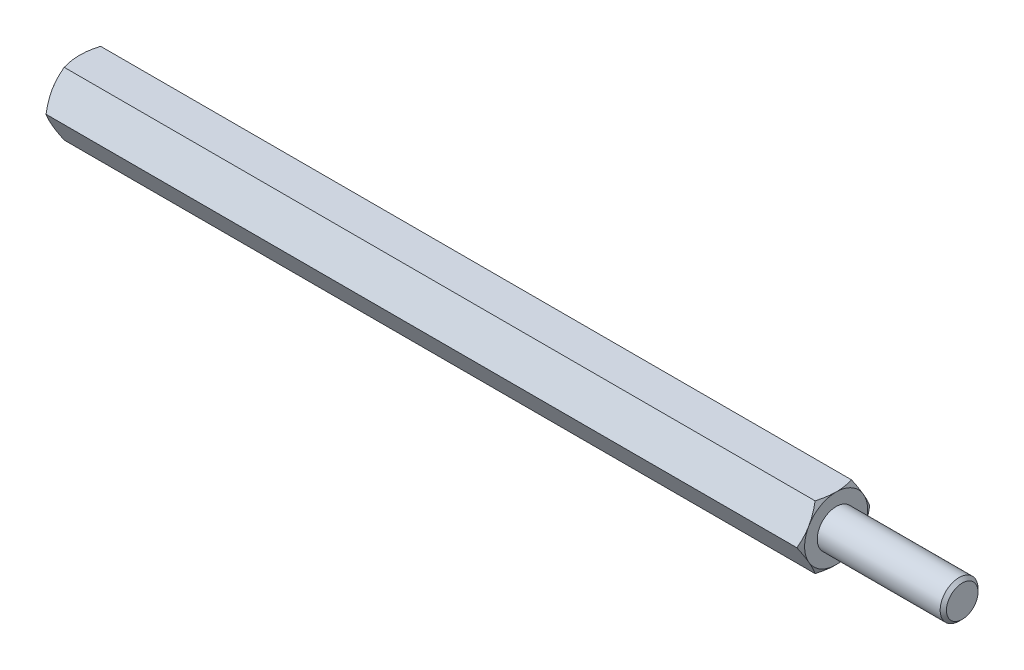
from build123d import *

# Parameters (mm, degrees)
EXTRUDE2_DEPTH = 30
SKETCH3_R      = 1.25
EXTRUDE3_DEPTH = 10
SKETCH5_R      = 1.5
EXTRUDE4_DEPTH = 10
CHAMFER1_SIZE  = 0.25


with BuildPart() as part:
    # Sketch1 → Extrude2 (new, symmetric)
    with BuildSketch(Plane(origin=(0, 0, 0), x_dir=(0, 0, -1), z_dir=(1, 0, 0))):
        Polygon((1.443375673, 2.5), (-1.443375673, 2.5), (-2.886751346, 0), (-1.443375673, -2.5), (1.443375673, -2.5), (2.886751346, 0), align=None)
    extrude(amount=EXTRUDE2_DEPTH, both=True)

    # Sketch2 → Cut-Revolve1 (revolve, cut)
    with BuildSketch(Plane.XY):
        with BuildLine():
            Line((-30, 2.5), (-28.5, 5.098076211))
            ThreePointArc((-28.5, 5.098076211), (-28.98810136, 6.276457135), (-30, 5.5))
            Line((-30, 5.5), (-30, 2.5))
        make_face()
    cut_revolve1 = revolve(axis=Axis((0, 0, 0), (1, 0, 0)), mode=Mode.SUBTRACT)

    # Mirror1: Cut-Revolve1 across plane
    add(cut_revolve1.mirror(Plane(origin=(0, 0, 0), x_dir=(0, 0, 1), z_dir=(1, 0, 0))), mode=Mode.SUBTRACT)

    # Sketch3 → Extrude3 (cut)
    with BuildSketch(Plane.ZY.offset(30)):
        Circle(SKETCH3_R)
    extrude(amount=-EXTRUDE3_DEPTH, mode=Mode.SUBTRACT)

    # Sketch4 → Cut-Revolve2 (revolve, cut)
    with BuildSketch(Plane.XY, mode=Mode.PRIVATE) as cut_revolve2_sk:
        Polygon((-20, 0), (-20, 1.25), (-19.278312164, 0), align=None)
    revolve(cut_revolve2_sk.sketch.rotate(Axis((-19.278312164, 0, 0), (-1, 0, 0)), 270), axis=Axis((-19.278312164, 0, 0), (-1, 0, 0)), mode=Mode.SUBTRACT)

    # Sketch5 → Extrude4 (add)
    with BuildSketch(Plane(origin=(30, 0, 0), x_dir=(0, 0, -1), z_dir=(1, 0, 0))):
        Circle(SKETCH5_R)
    extrude(amount=EXTRUDE4_DEPTH)

    # Chamfer1
    chamfer1_edges = [part.edges().sort_by_distance(p)[0] for p in [
        (40, 0, 1.5),
    ]]
    chamfer(chamfer1_edges, length=CHAMFER1_SIZE)


solid = part.part
